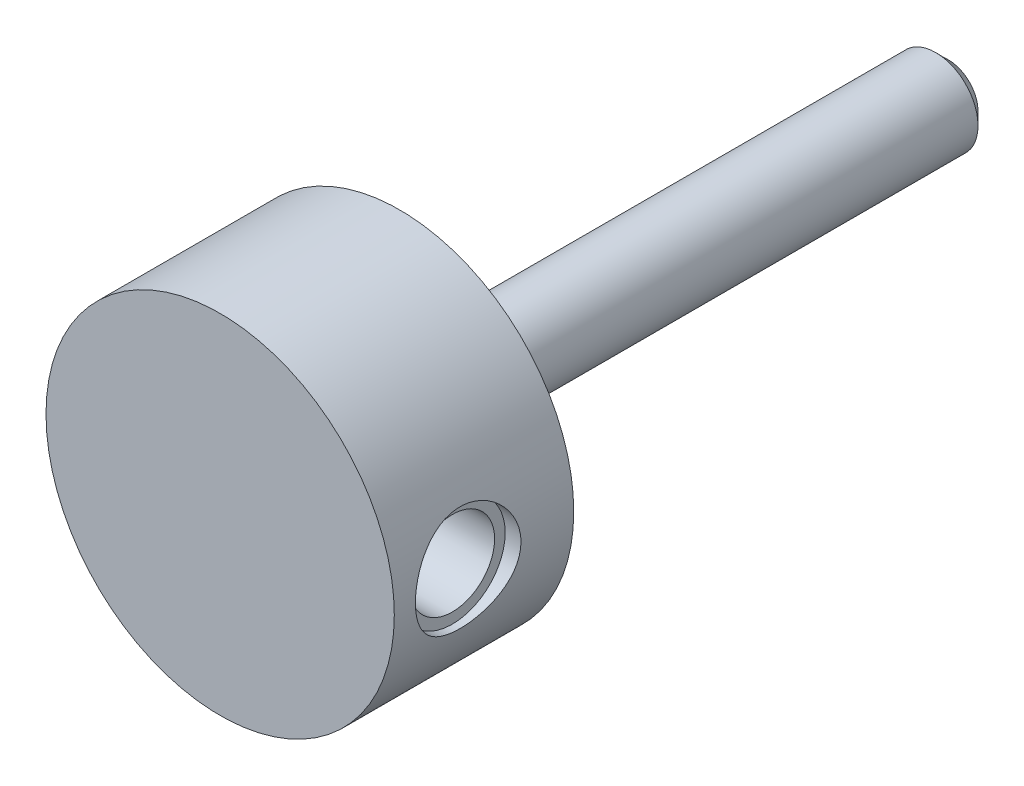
ISO-10303-21;
HEADER;
FILE_DESCRIPTION(('STEP AP214'),'2;1');
FILE_NAME('part.step','',(''),(''),'','','');
FILE_SCHEMA(('AUTOMOTIVE_DESIGN { 1 0 10303 214 1 1 1 1 }'));
ENDSEC;
DATA;
#1=APPLICATION_CONTEXT('core data for automotive mechanical design processes');
#2=APPLICATION_PROTOCOL_DEFINITION('international standard','automotive_design',2000,#1);
#3=PRODUCT_CONTEXT('',#1,'mechanical');
#4=PRODUCT('Part','Part','',(#3));
#5=PRODUCT_RELATED_PRODUCT_CATEGORY('part','',(#4));
#6=PRODUCT_DEFINITION_FORMATION('','',#4);
#7=PRODUCT_DEFINITION_CONTEXT('part definition',#1,'design');
#8=PRODUCT_DEFINITION('design','',#6,#7);
#9=PRODUCT_DEFINITION_SHAPE('','',#8);
#10=(LENGTH_UNIT() NAMED_UNIT(*) SI_UNIT(.MILLI.,.METRE.));
#11=(NAMED_UNIT(*) PLANE_ANGLE_UNIT() SI_UNIT($,.RADIAN.));
#12=(NAMED_UNIT(*) SI_UNIT($,.STERADIAN.) SOLID_ANGLE_UNIT());
#13=UNCERTAINTY_MEASURE_WITH_UNIT(LENGTH_MEASURE(1.E-05),#10,'distance_accuracy_value','');
#14=(GEOMETRIC_REPRESENTATION_CONTEXT(3) GLOBAL_UNCERTAINTY_ASSIGNED_CONTEXT((#13)) GLOBAL_UNIT_ASSIGNED_CONTEXT((#10,
#11,#12)) REPRESENTATION_CONTEXT('',''));
#15=CARTESIAN_POINT('',(0.,0.,0.));
#16=DIRECTION('',(0.,0.,1.));
#17=DIRECTION('',(1.,0.,0.));
#18=AXIS2_PLACEMENT_3D('',#15,#16,#17);
#19=CARTESIAN_POINT('',(0.,0.,0.));
#20=DIRECTION('',(0.,0.,1.));
#21=DIRECTION('',(1.,0.,0.));
#22=AXIS2_PLACEMENT_3D('',#19,#20,#21);
#23=PLANE('',#22);
#24=CARTESIAN_POINT('',(0.,0.,0.));
#25=DIRECTION('',(0.,0.,1.));
#26=DIRECTION('',(1.,0.,0.));
#27=AXIS2_PLACEMENT_3D('',#24,#25,#26);
#28=CIRCLE('',#27,6.75);
#29=CARTESIAN_POINT('',(6.75,0.,0.));
#30=VERTEX_POINT('',#29);
#31=EDGE_CURVE('E38',#30,#30,#28,.T.);
#32=ORIENTED_EDGE('',*,*,#31,.F.);
#33=EDGE_LOOP('',(#32));
#34=FACE_BOUND('',#33,.T.);
#35=CARTESIAN_POINT('',(0.,0.,0.));
#36=DIRECTION('',(0.,0.,1.));
#37=DIRECTION('',(1.,0.,0.));
#38=AXIS2_PLACEMENT_3D('',#35,#36,#37);
#39=CIRCLE('',#38,4.);
#40=CARTESIAN_POINT('',(4.,0.,0.));
#41=VERTEX_POINT('',#40);
#42=EDGE_CURVE('E23',#41,#41,#39,.F.);
#43=ORIENTED_EDGE('',*,*,#42,.F.);
#44=EDGE_LOOP('',(#43));
#45=FACE_BOUND('',#44,.T.);
#46=ADVANCED_FACE('F12',(#34,#45),#23,.F.);
#47=CARTESIAN_POINT('',(0.,0.,40.));
#48=DIRECTION('',(0.,0.,1.));
#49=DIRECTION('',(1.,0.,0.));
#50=AXIS2_PLACEMENT_3D('',#47,#48,#49);
#51=CYLINDRICAL_SURFACE('',#50,6.75);
#52=CARTESIAN_POINT('',(0.,0.,2.));
#53=DIRECTION('',(0.,0.,1.));
#54=DIRECTION('',(1.,0.,0.));
#55=AXIS2_PLACEMENT_3D('',#52,#53,#54);
#56=CIRCLE('',#55,6.75);
#57=CARTESIAN_POINT('',(6.75,0.,2.));
#58=VERTEX_POINT('',#57);
#59=EDGE_CURVE('E27',#58,#58,#56,.T.);
#60=ORIENTED_EDGE('',*,*,#59,.F.);
#61=EDGE_LOOP('',(#60));
#62=FACE_BOUND('',#61,.T.);
#63=ORIENTED_EDGE('',*,*,#31,.T.);
#64=EDGE_LOOP('',(#63));
#65=FACE_BOUND('',#64,.T.);
#66=ADVANCED_FACE('F51',(#62,#65),#51,.T.);
#67=CARTESIAN_POINT('',(6.75,0.,2.));
#68=DIRECTION('',(0.,0.,1.));
#69=DIRECTION('',(1.,0.,0.));
#70=AXIS2_PLACEMENT_3D('',#67,#68,#69);
#71=PLANE('',#70);
#72=CARTESIAN_POINT('',(0.,0.,2.));
#73=DIRECTION('',(0.,0.,1.));
#74=DIRECTION('',(1.,0.,0.));
#75=AXIS2_PLACEMENT_3D('',#72,#73,#74);
#76=CIRCLE('',#75,16.5);
#77=CARTESIAN_POINT('',(16.5,0.,2.));
#78=VERTEX_POINT('',#77);
#79=EDGE_CURVE('E70',#78,#78,#76,.T.);
#80=ORIENTED_EDGE('',*,*,#79,.F.);
#81=EDGE_LOOP('',(#80));
#82=FACE_BOUND('',#81,.T.);
#83=ORIENTED_EDGE('',*,*,#59,.T.);
#84=EDGE_LOOP('',(#83));
#85=FACE_BOUND('',#84,.T.);
#86=ADVANCED_FACE('F64',(#82,#85),#71,.F.);
#87=CARTESIAN_POINT('',(0.,0.,40.));
#88=DIRECTION('',(0.,0.,1.));
#89=DIRECTION('',(1.,0.,0.));
#90=AXIS2_PLACEMENT_3D('',#87,#88,#89);
#91=CYLINDRICAL_SURFACE('',#90,16.5);
#92=CARTESIAN_POINT('',(16.5,0.,7.));
#93=CARTESIAN_POINT('',(16.499997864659,-0.27416656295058,7.00000297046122));
#94=CARTESIAN_POINT('',(16.493101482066,-0.548363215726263,7.02262484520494));
#95=CARTESIAN_POINT('',(16.4662646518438,-1.08876356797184,7.11229452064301));
#96=CARTESIAN_POINT('',(16.446320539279,-1.35496499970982,7.17935480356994));
#97=CARTESIAN_POINT('',(16.3955720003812,-1.87150278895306,7.35545075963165));
#98=CARTESIAN_POINT('',(16.3647837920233,-2.12186218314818,7.4644237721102));
#99=CARTESIAN_POINT('',(16.2955420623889,-2.60075521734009,7.72099257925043));
#100=CARTESIAN_POINT('',(16.2570874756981,-2.82928581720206,7.86859374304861));
#101=CARTESIAN_POINT('',(16.1753529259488,-3.26471495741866,8.20277426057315));
#102=CARTESIAN_POINT('',(16.1319725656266,-3.47088543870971,8.39027763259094));
#103=CARTESIAN_POINT('',(16.0458704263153,-3.84938917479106,8.79697111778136));
#104=CARTESIAN_POINT('',(16.003148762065,-4.02171659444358,9.0161666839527));
#105=CARTESIAN_POINT('',(15.9221353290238,-4.33150150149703,9.48621682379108));
#106=CARTESIAN_POINT('',(15.8839681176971,-4.46806535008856,9.73768383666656));
#107=CARTESIAN_POINT('',(15.8178878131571,-4.69666762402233,10.2613575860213));
#108=CARTESIAN_POINT('',(15.7899722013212,-4.78871698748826,10.5335592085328));
#109=CARTESIAN_POINT('',(15.748602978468,-4.92304273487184,11.0827901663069));
#110=CARTESIAN_POINT('',(15.7347597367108,-4.96666335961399,11.3594605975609));
#111=CARTESIAN_POINT('',(15.7219440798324,-5.00709144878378,11.9165124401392));
#112=CARTESIAN_POINT('',(15.7229679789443,-5.00391051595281,12.1968929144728));
#113=CARTESIAN_POINT('',(15.7394259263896,-4.95188056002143,12.7424297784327));
#114=CARTESIAN_POINT('',(15.7543266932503,-4.90472150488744,13.0077661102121));
#115=CARTESIAN_POINT('',(15.7959958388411,-4.76880670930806,13.5265684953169));
#116=CARTESIAN_POINT('',(15.8227654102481,-4.68004678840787,13.7800333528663));
#117=CARTESIAN_POINT('',(15.8855774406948,-4.46221737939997,14.2720056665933));
#118=CARTESIAN_POINT('',(15.9217437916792,-4.33260397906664,14.5102558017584));
#119=CARTESIAN_POINT('',(15.9992154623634,-4.03712482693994,14.9621878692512));
#120=CARTESIAN_POINT('',(16.0405220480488,-3.87125013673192,15.1758637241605));
#121=CARTESIAN_POINT('',(16.125777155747,-3.49958783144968,15.5821595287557));
#122=CARTESIAN_POINT('',(16.1697632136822,-3.29239951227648,15.7734925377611));
#123=CARTESIAN_POINT('',(16.2538615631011,-2.84832978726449,16.1190003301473));
#124=CARTESIAN_POINT('',(16.2939736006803,-2.61144643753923,16.2731726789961));
#125=CARTESIAN_POINT('',(16.3661834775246,-2.11233821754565,16.540785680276));
#126=CARTESIAN_POINT('',(16.3982236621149,-1.84994861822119,16.6539357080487));
#127=CARTESIAN_POINT('',(16.4502641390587,-1.30866646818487,16.8341173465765));
#128=CARTESIAN_POINT('',(16.4702678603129,-1.02977864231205,16.9011620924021));
#129=CARTESIAN_POINT('',(16.4954369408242,-0.474353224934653,16.985075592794));
#130=CARTESIAN_POINT('',(16.5011177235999,-0.198102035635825,17.0036880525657));
#131=CARTESIAN_POINT('',(16.4985159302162,0.353597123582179,16.99510293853));
#132=CARTESIAN_POINT('',(16.4902352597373,0.629045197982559,16.9679116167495));
#133=CARTESIAN_POINT('',(16.4609787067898,1.16470330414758,16.869898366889));
#134=CARTESIAN_POINT('',(16.4403007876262,1.42511840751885,16.8000997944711));
#135=CARTESIAN_POINT('',(16.388649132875,1.93048096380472,16.6200887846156));
#136=CARTESIAN_POINT('',(16.3576741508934,2.17542653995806,16.5098714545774));
#137=CARTESIAN_POINT('',(16.2877277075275,2.64927766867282,16.2492534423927));
#138=CARTESIAN_POINT('',(16.2485858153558,2.87767261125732,16.097971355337));
#139=CARTESIAN_POINT('',(16.1667951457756,3.30642612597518,15.7605859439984));
#140=CARTESIAN_POINT('',(16.1241454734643,3.50677750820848,15.5744737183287));
#141=CARTESIAN_POINT('',(16.0381606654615,3.88146430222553,15.1645160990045));
#142=CARTESIAN_POINT('',(15.9948588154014,4.05455854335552,14.9395268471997));
#143=CARTESIAN_POINT('',(15.9141467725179,4.36062787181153,14.4627539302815));
#144=CARTESIAN_POINT('',(15.8767364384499,4.49360392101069,14.2109709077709));
#145=CARTESIAN_POINT('',(15.8124706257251,4.71477026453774,13.6884965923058));
#146=CARTESIAN_POINT('',(15.7855679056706,4.80316154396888,13.4178965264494));
#147=CARTESIAN_POINT('',(15.7455304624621,4.93284562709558,12.8646819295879));
#148=CARTESIAN_POINT('',(15.732390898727,4.97415499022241,12.5820716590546));
#149=CARTESIAN_POINT('',(15.7218509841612,5.00736143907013,12.0257720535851));
#150=CARTESIAN_POINT('',(15.7238051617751,5.00128483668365,11.7522143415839));
#151=CARTESIAN_POINT('',(15.7416767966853,4.94474176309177,11.2102140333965));
#152=CARTESIAN_POINT('',(15.7575936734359,4.89427713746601,10.9417712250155));
#153=CARTESIAN_POINT('',(15.8011599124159,4.75171037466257,10.4210074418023));
#154=CARTESIAN_POINT('',(15.8286548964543,4.66015510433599,10.1685228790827));
#155=CARTESIAN_POINT('',(15.8922482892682,4.43843275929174,9.68229661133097));
#156=CARTESIAN_POINT('',(15.9283483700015,4.30825817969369,9.44855856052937));
#157=CARTESIAN_POINT('',(16.0067548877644,4.00734203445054,8.99708364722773));
#158=CARTESIAN_POINT('',(16.0492418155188,3.83527527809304,8.78026142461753));
#159=CARTESIAN_POINT('',(16.1347696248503,3.45783157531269,8.3779118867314));
#160=CARTESIAN_POINT('',(16.1778106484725,3.25244592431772,8.19239277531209));
#161=CARTESIAN_POINT('',(16.2611473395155,2.80676565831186,7.85235596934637));
#162=CARTESIAN_POINT('',(16.301321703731,2.56560775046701,7.69893691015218));
#163=CARTESIAN_POINT('',(16.3729264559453,2.05970384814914,7.43503282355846));
#164=CARTESIAN_POINT('',(16.4043607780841,1.79496853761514,7.32452847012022));
#165=CARTESIAN_POINT('',(16.4523310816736,1.27725626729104,7.15905013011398));
#166=CARTESIAN_POINT('',(16.4700574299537,1.02582323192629,7.09957036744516));
#167=CARTESIAN_POINT('',(16.4938918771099,0.516268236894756,7.02004735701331));
#168=CARTESIAN_POINT('',(16.5000020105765,0.258147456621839,6.999997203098));
#169=CARTESIAN_POINT('',(16.5,0.,7.));
#170=B_SPLINE_CURVE_WITH_KNOTS('',3,(#92,#93,#94,#95,#96,#97,#98,#99,#100,#101,#102,#103,#104,
#105,#106,#107,#108,#109,#110,#111,#112,#113,#114,#115,#116,#117,#118,#119,#120,#121,#122,#123,
#124,#125,#126,#127,#128,#129,#130,#131,#132,#133,#134,#135,#136,#137,#138,#139,#140,#141,#142,
#143,#144,#145,#146,#147,#148,#149,#150,#151,#152,#153,#154,#155,#156,#157,#158,#159,#160,#161,
#162,#163,#164,#165,#166,#167,#168,#169),.UNSPECIFIED.,.T.,.F.,(4,2,2,2,2,2,2,2,2,2,2,2,2,2,2,2,
2,2,2,2,2,2,2,2,2,2,2,2,2,2,2,2,2,2,2,2,2,2,4),(0.,0.82155130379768,1.64333346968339,
2.46389179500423,3.28456423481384,4.12684629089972,4.96927344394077,5.83108565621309,
6.69268599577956,7.52972147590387,8.36654944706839,9.1724896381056,9.97851083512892,
10.7957518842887,11.6131946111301,12.4655059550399,13.3178731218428,14.1761660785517,
15.0342144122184,15.8609136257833,16.6875000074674,17.49497421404,18.302546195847,
19.1290491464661,19.9557636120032,20.8131534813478,21.6705227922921,22.5239918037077,
23.3771605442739,24.194052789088,25.0109110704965,25.8172062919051,26.6236583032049,
27.4600121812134,28.2965849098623,29.1582870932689,30.0196007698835,30.7932856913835,
31.5668350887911),.UNSPECIFIED.);
#171=CARTESIAN_POINT('',(16.5,0.,7.));
#172=VERTEX_POINT('',#171);
#173=EDGE_CURVE('E30',#172,#172,#170,.T.);
#174=ORIENTED_EDGE('',*,*,#173,.T.);
#175=EDGE_LOOP('',(#174));
#176=FACE_BOUND('',#175,.T.);
#177=CARTESIAN_POINT('',(0.,0.,19.));
#178=DIRECTION('',(0.,0.,1.));
#179=DIRECTION('',(1.,0.,0.));
#180=AXIS2_PLACEMENT_3D('',#177,#178,#179);
#181=CIRCLE('',#180,16.5);
#182=CARTESIAN_POINT('',(16.5,0.,19.));
#183=VERTEX_POINT('',#182);
#184=EDGE_CURVE('E68',#183,#183,#181,.T.);
#185=ORIENTED_EDGE('',*,*,#184,.F.);
#186=EDGE_LOOP('',(#185));
#187=FACE_BOUND('',#186,.T.);
#188=ORIENTED_EDGE('',*,*,#79,.T.);
#189=EDGE_LOOP('',(#188));
#190=FACE_BOUND('',#189,.T.);
#191=ADVANCED_FACE('F41',(#176,#187,#190),#91,.T.);
#192=CARTESIAN_POINT('',(16.5,0.,19.));
#193=DIRECTION('',(0.,0.,-1.));
#194=DIRECTION('',(-1.,0.,0.));
#195=AXIS2_PLACEMENT_3D('',#192,#193,#194);
#196=PLANE('',#195);
#197=ORIENTED_EDGE('',*,*,#184,.T.);
#198=EDGE_LOOP('',(#197));
#199=FACE_BOUND('',#198,.T.);
#200=ADVANCED_FACE('F53',(#199),#196,.F.);
#201=CARTESIAN_POINT('',(15.,0.,12.));
#202=DIRECTION('',(1.,0.,0.));
#203=DIRECTION('',(0.,0.,-1.));
#204=AXIS2_PLACEMENT_3D('',#201,#202,#203);
#205=CYLINDRICAL_SURFACE('',#204,5.);
#206=CARTESIAN_POINT('',(15.,0.,12.));
#207=DIRECTION('',(1.,0.,0.));
#208=DIRECTION('',(0.,0.,-1.));
#209=AXIS2_PLACEMENT_3D('',#206,#207,#208);
#210=CIRCLE('',#209,5.);
#211=CARTESIAN_POINT('',(15.,0.,7.));
#212=VERTEX_POINT('',#211);
#213=EDGE_CURVE('E39',#212,#212,#210,.T.);
#214=ORIENTED_EDGE('',*,*,#213,.F.);
#215=EDGE_LOOP('',(#214));
#216=FACE_BOUND('',#215,.T.);
#217=ORIENTED_EDGE('',*,*,#173,.F.);
#218=EDGE_LOOP('',(#217));
#219=FACE_BOUND('',#218,.T.);
#220=ADVANCED_FACE('F48',(#216,#219),#205,.F.);
#221=CARTESIAN_POINT('',(15.,0.,12.));
#222=DIRECTION('',(1.,0.,0.));
#223=DIRECTION('',(0.,0.,-1.));
#224=AXIS2_PLACEMENT_3D('',#221,#222,#223);
#225=PLANE('',#224);
#226=CARTESIAN_POINT('',(15.,0.,12.));
#227=DIRECTION('',(1.,0.,0.));
#228=DIRECTION('',(0.,0.,-1.));
#229=AXIS2_PLACEMENT_3D('',#226,#227,#228);
#230=CIRCLE('',#229,4.);
#231=CARTESIAN_POINT('',(15.,0.,8.));
#232=VERTEX_POINT('',#231);
#233=EDGE_CURVE('E81',#232,#232,#230,.T.);
#234=ORIENTED_EDGE('',*,*,#233,.F.);
#235=EDGE_LOOP('',(#234));
#236=FACE_BOUND('',#235,.T.);
#237=ORIENTED_EDGE('',*,*,#213,.T.);
#238=EDGE_LOOP('',(#237));
#239=FACE_BOUND('',#238,.T.);
#240=ADVANCED_FACE('F62',(#236,#239),#225,.T.);
#241=CARTESIAN_POINT('',(7.,0.,12.));
#242=DIRECTION('',(1.,0.,0.));
#243=DIRECTION('',(0.,0.,-1.));
#244=AXIS2_PLACEMENT_3D('',#241,#242,#243);
#245=CYLINDRICAL_SURFACE('',#244,4.);
#246=CARTESIAN_POINT('',(7.,0.,12.));
#247=DIRECTION('',(1.,0.,0.));
#248=DIRECTION('',(0.,0.,-1.));
#249=AXIS2_PLACEMENT_3D('',#246,#247,#248);
#250=CIRCLE('',#249,4.);
#251=CARTESIAN_POINT('',(7.,0.,8.));
#252=VERTEX_POINT('',#251);
#253=EDGE_CURVE('E78',#252,#252,#250,.T.);
#254=ORIENTED_EDGE('',*,*,#253,.F.);
#255=EDGE_LOOP('',(#254));
#256=FACE_BOUND('',#255,.T.);
#257=ORIENTED_EDGE('',*,*,#233,.T.);
#258=EDGE_LOOP('',(#257));
#259=FACE_BOUND('',#258,.T.);
#260=ADVANCED_FACE('F85',(#256,#259),#245,.F.);
#261=CARTESIAN_POINT('',(7.,0.,12.));
#262=DIRECTION('',(1.,0.,0.));
#263=DIRECTION('',(0.,0.,-1.));
#264=AXIS2_PLACEMENT_3D('',#261,#262,#263);
#265=PLANE('',#264);
#266=ORIENTED_EDGE('',*,*,#253,.T.);
#267=EDGE_LOOP('',(#266));
#268=FACE_BOUND('',#267,.T.);
#269=ADVANCED_FACE('F109',(#268),#265,.T.);
#270=CARTESIAN_POINT('',(0.,0.,-50.));
#271=DIRECTION('',(0.,0.,1.));
#272=DIRECTION('',(1.,0.,0.));
#273=AXIS2_PLACEMENT_3D('',#270,#271,#272);
#274=CYLINDRICAL_SURFACE('',#273,4.);
#275=CARTESIAN_POINT('',(0.,0.,-48.8));
#276=DIRECTION('',(0.,0.,-1.));
#277=DIRECTION('',(-1.,0.,0.));
#278=AXIS2_PLACEMENT_3D('',#275,#276,#277);
#279=CIRCLE('',#278,4.);
#280=CARTESIAN_POINT('',(-4.,0.,-48.8));
#281=VERTEX_POINT('',#280);
#282=EDGE_CURVE('E8',#281,#281,#279,.F.);
#283=ORIENTED_EDGE('',*,*,#282,.T.);
#284=EDGE_LOOP('',(#283));
#285=FACE_BOUND('',#284,.T.);
#286=ORIENTED_EDGE('',*,*,#42,.T.);
#287=EDGE_LOOP('',(#286));
#288=FACE_BOUND('',#287,.T.);
#289=ADVANCED_FACE('F106',(#285,#288),#274,.T.);
#290=CARTESIAN_POINT('',(0.,0.,-50.));
#291=DIRECTION('',(0.,0.,-1.));
#292=DIRECTION('',(-1.,0.,0.));
#293=AXIS2_PLACEMENT_3D('',#290,#291,#292);
#294=PLANE('',#293);
#295=CARTESIAN_POINT('',(0.,0.,-50.));
#296=DIRECTION('',(0.,0.,-1.));
#297=DIRECTION('',(-1.,0.,0.));
#298=AXIS2_PLACEMENT_3D('',#295,#296,#297);
#299=CIRCLE('',#298,2.8);
#300=CARTESIAN_POINT('',(-2.8,0.,-50.));
#301=VERTEX_POINT('',#300);
#302=EDGE_CURVE('E19',#301,#301,#299,.T.);
#303=ORIENTED_EDGE('',*,*,#302,.T.);
#304=EDGE_LOOP('',(#303));
#305=FACE_BOUND('',#304,.T.);
#306=ADVANCED_FACE('F108',(#305),#294,.T.);
#307=CARTESIAN_POINT('',(0.,0.,-50.));
#308=DIRECTION('',(0.,0.,1.));
#309=DIRECTION('',(1.,0.,0.));
#310=AXIS2_PLACEMENT_3D('',#307,#308,#309);
#311=CONICAL_SURFACE('',#310,2.8,0.78539816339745);
#312=ORIENTED_EDGE('',*,*,#282,.F.);
#313=EDGE_LOOP('',(#312));
#314=FACE_BOUND('',#313,.T.);
#315=ORIENTED_EDGE('',*,*,#302,.F.);
#316=EDGE_LOOP('',(#315));
#317=FACE_BOUND('',#316,.T.);
#318=ADVANCED_FACE('F14',(#314,#317),#311,.T.);
#319=CLOSED_SHELL('',(#46,#66,#86,#191,#200,#220,#240,#260,#269,#289,#306,#318));
#320=MANIFOLD_SOLID_BREP('B1',#319);
#321=ADVANCED_BREP_SHAPE_REPRESENTATION('',(#18,#320),#14);
#322=SHAPE_DEFINITION_REPRESENTATION(#9,#321);
ENDSEC;
END-ISO-10303-21;
